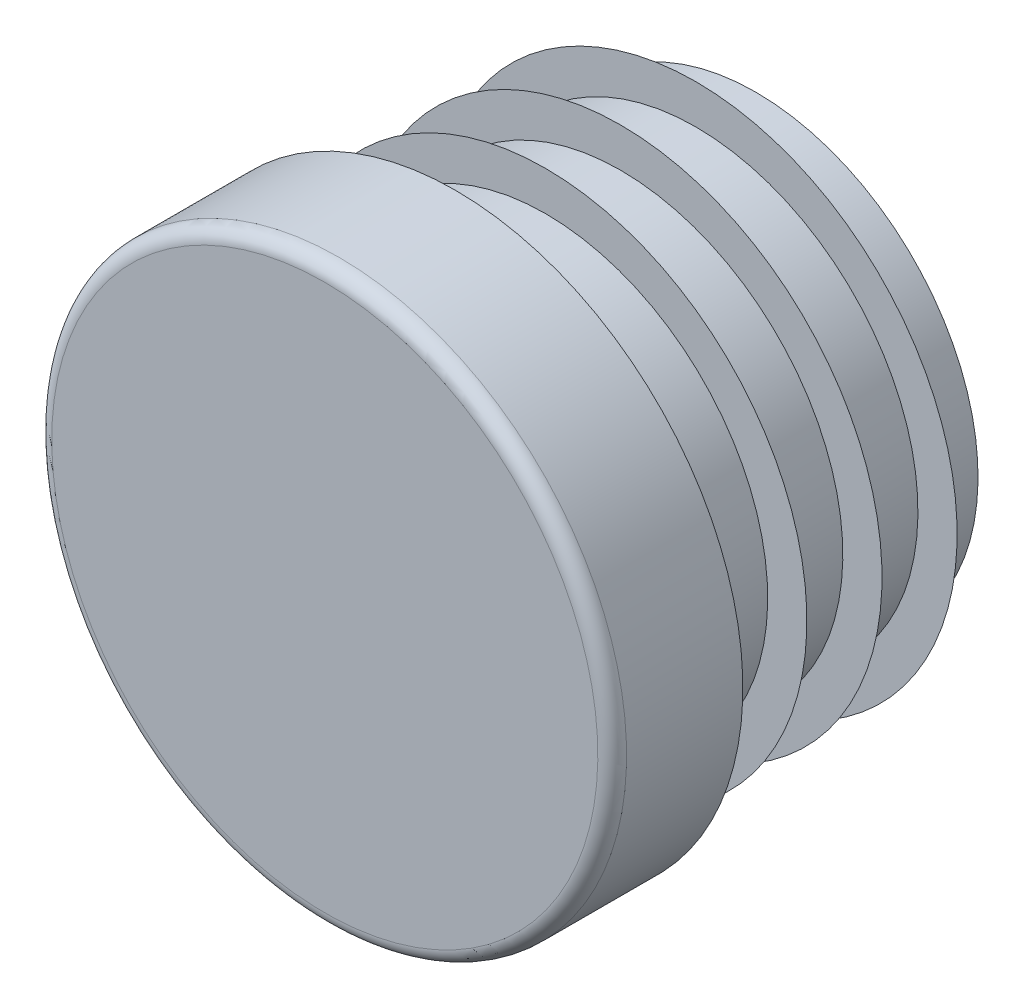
ISO-10303-21;
HEADER;
FILE_DESCRIPTION(('STEP AP214'),'2;1');
FILE_NAME('part.step','',(''),(''),'','','');
FILE_SCHEMA(('AUTOMOTIVE_DESIGN { 1 0 10303 214 1 1 1 1 }'));
ENDSEC;
DATA;
#1=APPLICATION_CONTEXT('core data for automotive mechanical design processes');
#2=APPLICATION_PROTOCOL_DEFINITION('international standard','automotive_design',2000,#1);
#3=PRODUCT_CONTEXT('',#1,'mechanical');
#4=PRODUCT('Part','Part','',(#3));
#5=PRODUCT_RELATED_PRODUCT_CATEGORY('part','',(#4));
#6=PRODUCT_DEFINITION_FORMATION('','',#4);
#7=PRODUCT_DEFINITION_CONTEXT('part definition',#1,'design');
#8=PRODUCT_DEFINITION('design','',#6,#7);
#9=PRODUCT_DEFINITION_SHAPE('','',#8);
#10=(LENGTH_UNIT() NAMED_UNIT(*) SI_UNIT(.MILLI.,.METRE.));
#11=(NAMED_UNIT(*) PLANE_ANGLE_UNIT() SI_UNIT($,.RADIAN.));
#12=(NAMED_UNIT(*) SI_UNIT($,.STERADIAN.) SOLID_ANGLE_UNIT());
#13=UNCERTAINTY_MEASURE_WITH_UNIT(LENGTH_MEASURE(1.E-05),#10,'distance_accuracy_value','');
#14=(GEOMETRIC_REPRESENTATION_CONTEXT(3) GLOBAL_UNCERTAINTY_ASSIGNED_CONTEXT((#13)) GLOBAL_UNIT_ASSIGNED_CONTEXT((#10,
#11,#12)) REPRESENTATION_CONTEXT('',''));
#15=CARTESIAN_POINT('',(0.,0.,0.));
#16=DIRECTION('',(0.,0.,1.));
#17=DIRECTION('',(1.,0.,0.));
#18=AXIS2_PLACEMENT_3D('',#15,#16,#17);
#19=CARTESIAN_POINT('',(0.,0.,5.));
#20=DIRECTION('',(0.,0.,-1.));
#21=DIRECTION('',(0.,1.,0.));
#22=AXIS2_PLACEMENT_3D('',#19,#20,#21);
#23=PLANE('',#22);
#24=CARTESIAN_POINT('',(0.,0.,5.));
#25=DIRECTION('',(0.,0.,-1.));
#26=DIRECTION('',(0.,1.,0.));
#27=AXIS2_PLACEMENT_3D('',#24,#25,#26);
#28=CIRCLE('',#27,10.45);
#29=CARTESIAN_POINT('',(0.,10.45,5.));
#30=VERTEX_POINT('',#29);
#31=EDGE_CURVE('E8',#30,#30,#28,.T.);
#32=ORIENTED_EDGE('',*,*,#31,.F.);
#33=EDGE_LOOP('',(#32));
#34=FACE_BOUND('',#33,.T.);
#35=ADVANCED_FACE('F12',(#34),#23,.F.);
#36=CARTESIAN_POINT('',(0.,0.,4.45));
#37=DIRECTION('',(0.,0.,-1.));
#38=DIRECTION('',(0.,1.,0.));
#39=AXIS2_PLACEMENT_3D('',#36,#37,#38);
#40=TOROIDAL_SURFACE('',#39,10.45,0.55);
#41=ORIENTED_EDGE('',*,*,#31,.T.);
#42=EDGE_LOOP('',(#41));
#43=FACE_BOUND('',#42,.T.);
#44=CARTESIAN_POINT('',(0.,0.,4.45000000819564));
#45=DIRECTION('',(0.,0.,-1.));
#46=DIRECTION('',(0.,1.,0.));
#47=AXIS2_PLACEMENT_3D('',#44,#45,#46);
#48=CIRCLE('',#47,11.);
#49=CARTESIAN_POINT('',(0.,11.,4.45000000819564));
#50=VERTEX_POINT('',#49);
#51=EDGE_CURVE('E18',#50,#50,#48,.T.);
#52=ORIENTED_EDGE('',*,*,#51,.F.);
#53=EDGE_LOOP('',(#52));
#54=FACE_BOUND('',#53,.T.);
#55=ADVANCED_FACE('F159',(#43,#54),#40,.T.);
#56=CARTESIAN_POINT('',(0.,0.,-11.5));
#57=DIRECTION('',(0.,0.,-1.));
#58=DIRECTION('',(0.,1.,0.));
#59=AXIS2_PLACEMENT_3D('',#56,#57,#58);
#60=CYLINDRICAL_SURFACE('',#59,11.);
#61=CARTESIAN_POINT('',(0.,0.,0.));
#62=DIRECTION('',(0.,0.,-1.));
#63=DIRECTION('',(0.,1.,0.));
#64=AXIS2_PLACEMENT_3D('',#61,#62,#63);
#65=CIRCLE('',#64,11.);
#66=CARTESIAN_POINT('',(0.,11.,0.));
#67=VERTEX_POINT('',#66);
#68=EDGE_CURVE('E22',#67,#67,#65,.T.);
#69=ORIENTED_EDGE('',*,*,#68,.F.);
#70=EDGE_LOOP('',(#69));
#71=FACE_BOUND('',#70,.T.);
#72=ORIENTED_EDGE('',*,*,#51,.T.);
#73=EDGE_LOOP('',(#72));
#74=FACE_BOUND('',#73,.T.);
#75=ADVANCED_FACE('F154',(#71,#74),#60,.T.);
#76=CARTESIAN_POINT('',(11.,0.,0.));
#77=DIRECTION('',(0.,0.,1.));
#78=DIRECTION('',(0.,-1.,0.));
#79=AXIS2_PLACEMENT_3D('',#76,#77,#78);
#80=PLANE('',#79);
#81=CARTESIAN_POINT('',(0.,0.,0.));
#82=DIRECTION('',(0.,0.,-1.));
#83=DIRECTION('',(0.,1.,0.));
#84=AXIS2_PLACEMENT_3D('',#81,#82,#83);
#85=CIRCLE('',#84,8.5);
#86=CARTESIAN_POINT('',(0.,8.5,0.));
#87=VERTEX_POINT('',#86);
#88=EDGE_CURVE('E26',#87,#87,#85,.T.);
#89=ORIENTED_EDGE('',*,*,#88,.F.);
#90=EDGE_LOOP('',(#89));
#91=FACE_BOUND('',#90,.T.);
#92=ORIENTED_EDGE('',*,*,#68,.T.);
#93=EDGE_LOOP('',(#92));
#94=FACE_BOUND('',#93,.T.);
#95=ADVANCED_FACE('F148',(#91,#94),#80,.F.);
#96=CARTESIAN_POINT('',(0.,0.,-11.5));
#97=DIRECTION('',(0.,0.,-1.));
#98=DIRECTION('',(0.,1.,0.));
#99=AXIS2_PLACEMENT_3D('',#96,#97,#98);
#100=CYLINDRICAL_SURFACE('',#99,8.5);
#101=CARTESIAN_POINT('',(0.,0.,-0.575));
#102=DIRECTION('',(0.,0.,-1.));
#103=DIRECTION('',(0.,1.,0.));
#104=AXIS2_PLACEMENT_3D('',#101,#102,#103);
#105=CIRCLE('',#104,8.5);
#106=CARTESIAN_POINT('',(0.,8.5,-0.575));
#107=VERTEX_POINT('',#106);
#108=EDGE_CURVE('E31',#107,#107,#105,.T.);
#109=ORIENTED_EDGE('',*,*,#108,.F.);
#110=EDGE_LOOP('',(#109));
#111=FACE_BOUND('',#110,.T.);
#112=ORIENTED_EDGE('',*,*,#88,.T.);
#113=EDGE_LOOP('',(#112));
#114=FACE_BOUND('',#113,.T.);
#115=ADVANCED_FACE('F142',(#111,#114),#100,.T.);
#116=CARTESIAN_POINT('',(8.5,0.,-0.575));
#117=DIRECTION('',(0.,0.,-1.));
#118=DIRECTION('',(0.,1.,0.));
#119=AXIS2_PLACEMENT_3D('',#116,#117,#118);
#120=PLANE('',#119);
#121=CARTESIAN_POINT('',(0.,0.,-0.575));
#122=DIRECTION('',(0.,0.,-1.));
#123=DIRECTION('',(0.,1.,0.));
#124=AXIS2_PLACEMENT_3D('',#121,#122,#123);
#125=CIRCLE('',#124,10.);
#126=CARTESIAN_POINT('',(0.,10.,-0.575));
#127=VERTEX_POINT('',#126);
#128=EDGE_CURVE('E34',#127,#127,#125,.T.);
#129=ORIENTED_EDGE('',*,*,#128,.F.);
#130=EDGE_LOOP('',(#129));
#131=FACE_BOUND('',#130,.T.);
#132=ORIENTED_EDGE('',*,*,#108,.T.);
#133=EDGE_LOOP('',(#132));
#134=FACE_BOUND('',#133,.T.);
#135=ADVANCED_FACE('F136',(#131,#134),#120,.F.);
#136=CARTESIAN_POINT('',(0.,0.,-0.575));
#137=DIRECTION('',(0.,0.,1.));
#138=DIRECTION('',(0.,-1.,0.));
#139=AXIS2_PLACEMENT_3D('',#136,#137,#138);
#140=CONICAL_SURFACE('',#139,10.,0.959931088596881);
#141=CARTESIAN_POINT('',(0.,0.,-1.62531130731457));
#142=DIRECTION('',(0.,0.,-1.));
#143=DIRECTION('',(0.,1.,0.));
#144=AXIS2_PLACEMENT_3D('',#141,#142,#143);
#145=CIRCLE('',#144,8.5);
#146=CARTESIAN_POINT('',(0.,8.5,-1.62531130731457));
#147=VERTEX_POINT('',#146);
#148=EDGE_CURVE('E37',#147,#147,#145,.T.);
#149=ORIENTED_EDGE('',*,*,#148,.F.);
#150=EDGE_LOOP('',(#149));
#151=FACE_BOUND('',#150,.T.);
#152=ORIENTED_EDGE('',*,*,#128,.T.);
#153=EDGE_LOOP('',(#152));
#154=FACE_BOUND('',#153,.T.);
#155=ADVANCED_FACE('F130',(#151,#154),#140,.T.);
#156=CARTESIAN_POINT('',(0.,0.,-11.5));
#157=DIRECTION('',(0.,0.,-1.));
#158=DIRECTION('',(0.,1.,0.));
#159=AXIS2_PLACEMENT_3D('',#156,#157,#158);
#160=CYLINDRICAL_SURFACE('',#159,8.5);
#161=CARTESIAN_POINT('',(0.,0.,-3.45));
#162=DIRECTION('',(0.,0.,-1.));
#163=DIRECTION('',(0.,1.,0.));
#164=AXIS2_PLACEMENT_3D('',#161,#162,#163);
#165=CIRCLE('',#164,8.5);
#166=CARTESIAN_POINT('',(0.,8.5,-3.45));
#167=VERTEX_POINT('',#166);
#168=EDGE_CURVE('E40',#167,#167,#165,.T.);
#169=ORIENTED_EDGE('',*,*,#168,.F.);
#170=EDGE_LOOP('',(#169));
#171=FACE_BOUND('',#170,.T.);
#172=ORIENTED_EDGE('',*,*,#148,.T.);
#173=EDGE_LOOP('',(#172));
#174=FACE_BOUND('',#173,.T.);
#175=ADVANCED_FACE('F124',(#171,#174),#160,.T.);
#176=CARTESIAN_POINT('',(8.5,0.,-3.45));
#177=DIRECTION('',(0.,0.,-1.));
#178=DIRECTION('',(0.,1.,0.));
#179=AXIS2_PLACEMENT_3D('',#176,#177,#178);
#180=PLANE('',#179);
#181=CARTESIAN_POINT('',(0.,0.,-3.45));
#182=DIRECTION('',(0.,0.,-1.));
#183=DIRECTION('',(0.,1.,0.));
#184=AXIS2_PLACEMENT_3D('',#181,#182,#183);
#185=CIRCLE('',#184,10.);
#186=CARTESIAN_POINT('',(0.,10.,-3.45));
#187=VERTEX_POINT('',#186);
#188=EDGE_CURVE('E43',#187,#187,#185,.T.);
#189=ORIENTED_EDGE('',*,*,#188,.F.);
#190=EDGE_LOOP('',(#189));
#191=FACE_BOUND('',#190,.T.);
#192=ORIENTED_EDGE('',*,*,#168,.T.);
#193=EDGE_LOOP('',(#192));
#194=FACE_BOUND('',#193,.T.);
#195=ADVANCED_FACE('F118',(#191,#194),#180,.F.);
#196=CARTESIAN_POINT('',(0.,0.,-3.45));
#197=DIRECTION('',(0.,0.,1.));
#198=DIRECTION('',(0.,-1.,0.));
#199=AXIS2_PLACEMENT_3D('',#196,#197,#198);
#200=CONICAL_SURFACE('',#199,10.,0.959931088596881);
#201=CARTESIAN_POINT('',(0.,0.,-4.50031130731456));
#202=DIRECTION('',(0.,0.,-1.));
#203=DIRECTION('',(0.,1.,0.));
#204=AXIS2_PLACEMENT_3D('',#201,#202,#203);
#205=CIRCLE('',#204,8.5);
#206=CARTESIAN_POINT('',(0.,8.5,-4.50031130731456));
#207=VERTEX_POINT('',#206);
#208=EDGE_CURVE('E46',#207,#207,#205,.T.);
#209=ORIENTED_EDGE('',*,*,#208,.F.);
#210=EDGE_LOOP('',(#209));
#211=FACE_BOUND('',#210,.T.);
#212=ORIENTED_EDGE('',*,*,#188,.T.);
#213=EDGE_LOOP('',(#212));
#214=FACE_BOUND('',#213,.T.);
#215=ADVANCED_FACE('F112',(#211,#214),#200,.T.);
#216=CARTESIAN_POINT('',(0.,0.,-11.5));
#217=DIRECTION('',(0.,0.,-1.));
#218=DIRECTION('',(0.,1.,0.));
#219=AXIS2_PLACEMENT_3D('',#216,#217,#218);
#220=CYLINDRICAL_SURFACE('',#219,8.5);
#221=CARTESIAN_POINT('',(0.,0.,-6.325));
#222=DIRECTION('',(0.,0.,-1.));
#223=DIRECTION('',(0.,1.,0.));
#224=AXIS2_PLACEMENT_3D('',#221,#222,#223);
#225=CIRCLE('',#224,8.5);
#226=CARTESIAN_POINT('',(0.,8.5,-6.325));
#227=VERTEX_POINT('',#226);
#228=EDGE_CURVE('E49',#227,#227,#225,.T.);
#229=ORIENTED_EDGE('',*,*,#228,.F.);
#230=EDGE_LOOP('',(#229));
#231=FACE_BOUND('',#230,.T.);
#232=ORIENTED_EDGE('',*,*,#208,.T.);
#233=EDGE_LOOP('',(#232));
#234=FACE_BOUND('',#233,.T.);
#235=ADVANCED_FACE('F106',(#231,#234),#220,.T.);
#236=CARTESIAN_POINT('',(8.5,0.,-6.325));
#237=DIRECTION('',(0.,0.,-1.));
#238=DIRECTION('',(0.,1.,0.));
#239=AXIS2_PLACEMENT_3D('',#236,#237,#238);
#240=PLANE('',#239);
#241=CARTESIAN_POINT('',(0.,0.,-6.325));
#242=DIRECTION('',(0.,0.,-1.));
#243=DIRECTION('',(0.,1.,0.));
#244=AXIS2_PLACEMENT_3D('',#241,#242,#243);
#245=CIRCLE('',#244,10.);
#246=CARTESIAN_POINT('',(0.,10.,-6.325));
#247=VERTEX_POINT('',#246);
#248=EDGE_CURVE('E52',#247,#247,#245,.T.);
#249=ORIENTED_EDGE('',*,*,#248,.F.);
#250=EDGE_LOOP('',(#249));
#251=FACE_BOUND('',#250,.T.);
#252=ORIENTED_EDGE('',*,*,#228,.T.);
#253=EDGE_LOOP('',(#252));
#254=FACE_BOUND('',#253,.T.);
#255=ADVANCED_FACE('F100',(#251,#254),#240,.F.);
#256=CARTESIAN_POINT('',(0.,0.,-6.325));
#257=DIRECTION('',(0.,0.,1.));
#258=DIRECTION('',(0.,-1.,0.));
#259=AXIS2_PLACEMENT_3D('',#256,#257,#258);
#260=CONICAL_SURFACE('',#259,10.,0.959931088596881);
#261=CARTESIAN_POINT('',(0.,0.,-7.37531130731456));
#262=DIRECTION('',(0.,0.,-1.));
#263=DIRECTION('',(0.,1.,0.));
#264=AXIS2_PLACEMENT_3D('',#261,#262,#263);
#265=CIRCLE('',#264,8.5);
#266=CARTESIAN_POINT('',(0.,8.5,-7.37531130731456));
#267=VERTEX_POINT('',#266);
#268=EDGE_CURVE('E55',#267,#267,#265,.T.);
#269=ORIENTED_EDGE('',*,*,#268,.F.);
#270=EDGE_LOOP('',(#269));
#271=FACE_BOUND('',#270,.T.);
#272=ORIENTED_EDGE('',*,*,#248,.T.);
#273=EDGE_LOOP('',(#272));
#274=FACE_BOUND('',#273,.T.);
#275=ADVANCED_FACE('F94',(#271,#274),#260,.T.);
#276=CARTESIAN_POINT('',(0.,0.,-11.5));
#277=DIRECTION('',(0.,0.,-1.));
#278=DIRECTION('',(0.,1.,0.));
#279=AXIS2_PLACEMENT_3D('',#276,#277,#278);
#280=CYLINDRICAL_SURFACE('',#279,8.5);
#281=CARTESIAN_POINT('',(0.,0.,-9.2));
#282=DIRECTION('',(0.,0.,-1.));
#283=DIRECTION('',(0.,1.,0.));
#284=AXIS2_PLACEMENT_3D('',#281,#282,#283);
#285=CIRCLE('',#284,8.5);
#286=CARTESIAN_POINT('',(0.,8.5,-9.2));
#287=VERTEX_POINT('',#286);
#288=EDGE_CURVE('E58',#287,#287,#285,.T.);
#289=ORIENTED_EDGE('',*,*,#288,.F.);
#290=EDGE_LOOP('',(#289));
#291=FACE_BOUND('',#290,.T.);
#292=ORIENTED_EDGE('',*,*,#268,.T.);
#293=EDGE_LOOP('',(#292));
#294=FACE_BOUND('',#293,.T.);
#295=ADVANCED_FACE('F88',(#291,#294),#280,.T.);
#296=CARTESIAN_POINT('',(8.5,0.,-9.2));
#297=DIRECTION('',(0.,0.,-1.));
#298=DIRECTION('',(0.,1.,0.));
#299=AXIS2_PLACEMENT_3D('',#296,#297,#298);
#300=PLANE('',#299);
#301=CARTESIAN_POINT('',(0.,0.,-9.2));
#302=DIRECTION('',(0.,0.,-1.));
#303=DIRECTION('',(0.,1.,0.));
#304=AXIS2_PLACEMENT_3D('',#301,#302,#303);
#305=CIRCLE('',#304,10.);
#306=CARTESIAN_POINT('',(0.,10.,-9.2));
#307=VERTEX_POINT('',#306);
#308=EDGE_CURVE('E61',#307,#307,#305,.T.);
#309=ORIENTED_EDGE('',*,*,#308,.F.);
#310=EDGE_LOOP('',(#309));
#311=FACE_BOUND('',#310,.T.);
#312=ORIENTED_EDGE('',*,*,#288,.T.);
#313=EDGE_LOOP('',(#312));
#314=FACE_BOUND('',#313,.T.);
#315=ADVANCED_FACE('F82',(#311,#314),#300,.F.);
#316=CARTESIAN_POINT('',(0.,0.,-9.2));
#317=DIRECTION('',(0.,0.,1.));
#318=DIRECTION('',(0.,-1.,0.));
#319=AXIS2_PLACEMENT_3D('',#316,#317,#318);
#320=CONICAL_SURFACE('',#319,10.,0.959931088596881);
#321=CARTESIAN_POINT('',(0.,0.,-10.2503113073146));
#322=DIRECTION('',(0.,0.,-1.));
#323=DIRECTION('',(0.,1.,0.));
#324=AXIS2_PLACEMENT_3D('',#321,#322,#323);
#325=CIRCLE('',#324,8.5);
#326=CARTESIAN_POINT('',(0.,8.5,-10.2503113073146));
#327=VERTEX_POINT('',#326);
#328=EDGE_CURVE('E64',#327,#327,#325,.T.);
#329=ORIENTED_EDGE('',*,*,#328,.F.);
#330=EDGE_LOOP('',(#329));
#331=FACE_BOUND('',#330,.T.);
#332=ORIENTED_EDGE('',*,*,#308,.T.);
#333=EDGE_LOOP('',(#332));
#334=FACE_BOUND('',#333,.T.);
#335=ADVANCED_FACE('F76',(#331,#334),#320,.T.);
#336=CARTESIAN_POINT('',(0.,0.,-11.5));
#337=DIRECTION('',(0.,0.,-1.));
#338=DIRECTION('',(0.,1.,0.));
#339=AXIS2_PLACEMENT_3D('',#336,#337,#338);
#340=CYLINDRICAL_SURFACE('',#339,8.5);
#341=CARTESIAN_POINT('',(0.,0.,-11.5));
#342=DIRECTION('',(0.,0.,-1.));
#343=DIRECTION('',(0.,1.,0.));
#344=AXIS2_PLACEMENT_3D('',#341,#342,#343);
#345=CIRCLE('',#344,8.5);
#346=CARTESIAN_POINT('',(0.,8.5,-11.5));
#347=VERTEX_POINT('',#346);
#348=EDGE_CURVE('E67',#347,#347,#345,.T.);
#349=ORIENTED_EDGE('',*,*,#348,.F.);
#350=EDGE_LOOP('',(#349));
#351=FACE_BOUND('',#350,.T.);
#352=ORIENTED_EDGE('',*,*,#328,.T.);
#353=EDGE_LOOP('',(#352));
#354=FACE_BOUND('',#353,.T.);
#355=ADVANCED_FACE('F73',(#351,#354),#340,.T.);
#356=CARTESIAN_POINT('',(8.5,0.,-11.5));
#357=DIRECTION('',(0.,0.,1.));
#358=DIRECTION('',(0.,-1.,0.));
#359=AXIS2_PLACEMENT_3D('',#356,#357,#358);
#360=PLANE('',#359);
#361=ORIENTED_EDGE('',*,*,#348,.T.);
#362=EDGE_LOOP('',(#361));
#363=FACE_BOUND('',#362,.T.);
#364=ADVANCED_FACE('F71',(#363),#360,.F.);
#365=CLOSED_SHELL('',(#35,#55,#75,#95,#115,#135,#155,#175,#195,#215,#235,#255,#275,#295,#315,
#335,#355,#364));
#366=MANIFOLD_SOLID_BREP('B1',#365);
#367=ADVANCED_BREP_SHAPE_REPRESENTATION('',(#18,#366),#14);
#368=SHAPE_DEFINITION_REPRESENTATION(#9,#367);
ENDSEC;
END-ISO-10303-21;
